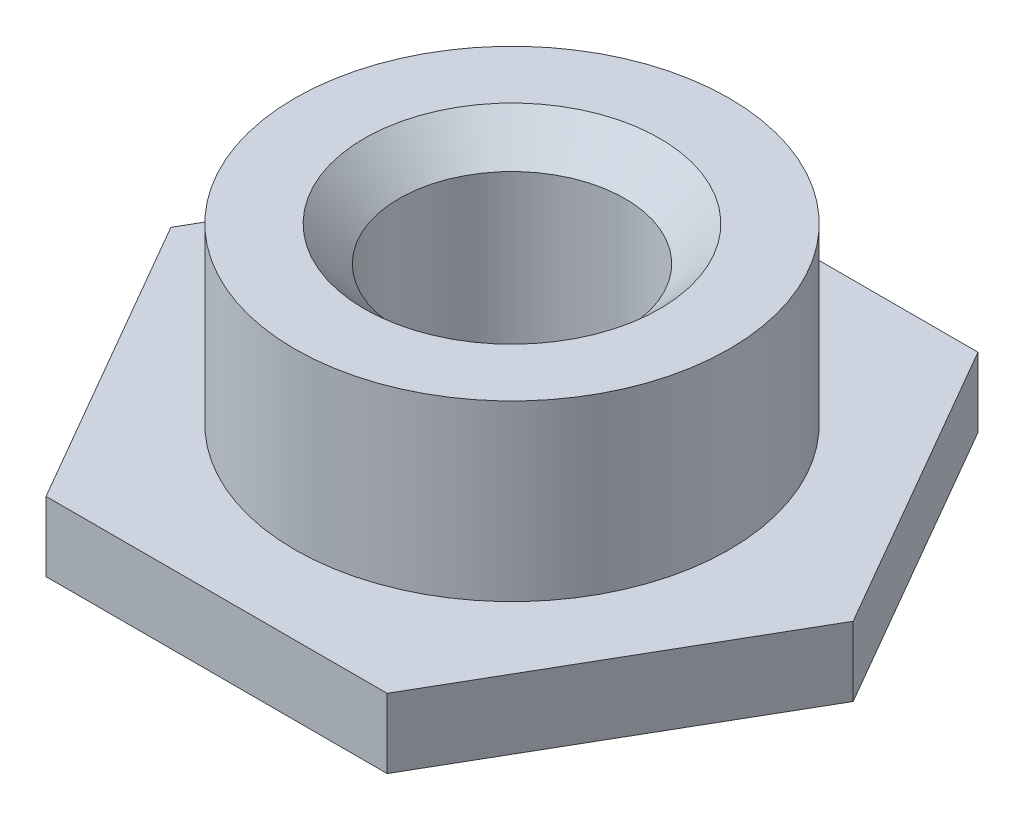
from build123d import *

# Parameters (mm, degrees)
EXTRUDE_1_DEPTH     = 2
SKETCH_2_R          = 6.25
EXTRUDE_2_DEPTH     = 5
SKETCH_3_R          = 3.25
CUT_EXTRUDE_1_DEPTH = 15.750706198
CHAMFER_1_SIZE      = 1
CHAMFER_2_SIZE      = 0.5


with BuildPart() as part:
    # Sketch 1 → Extrude 1 (new body)
    with BuildSketch(Plane(origin=(0, 0, 0), x_dir=(1, 0, 0), z_dir=(0, 1, 0))):
        Polygon((9.814954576, 0), (4.907477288, 8.5), (-4.907477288, 8.5), (-9.814954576, 0), (-4.907477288, -8.5), (4.907477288, -8.5), align=None)
    extrude(amount=EXTRUDE_1_DEPTH)

    # Sketch 2 → Extrude 2 (add)
    with BuildSketch(Plane(origin=(0, 2, 0), x_dir=(1, 0, 0), z_dir=(0, 1, 0))):
        with Locations(Location((0, 0, 0), (0, 0, 270))):
            Circle(SKETCH_2_R)
    extrude(amount=EXTRUDE_2_DEPTH)

    # Sketch 3 → Cut-Extrude 1 (cut, through all)
    with BuildSketch(Plane(origin=(0, 7, 0), x_dir=(1, 0, 0), z_dir=(0, 1, 0))):
        with Locations(Location((0, 0, 0), (0, 0, 270))):
            Circle(SKETCH_3_R)
    extrude(amount=-CUT_EXTRUDE_1_DEPTH, mode=Mode.SUBTRACT)

    # Chamfer 1
    chamfer_1_edges = [part.edges().sort_by_distance(p)[0] for p in [
        (0, 7, -3.25),
    ]]
    chamfer(chamfer_1_edges, length=CHAMFER_1_SIZE)

    # Chamfer 2
    chamfer_2_edges = [part.edges().sort_by_distance(p)[0] for p in [
        (0, 0, -3.25),
    ]]
    chamfer(chamfer_2_edges, length=CHAMFER_2_SIZE)


solid = part.part
